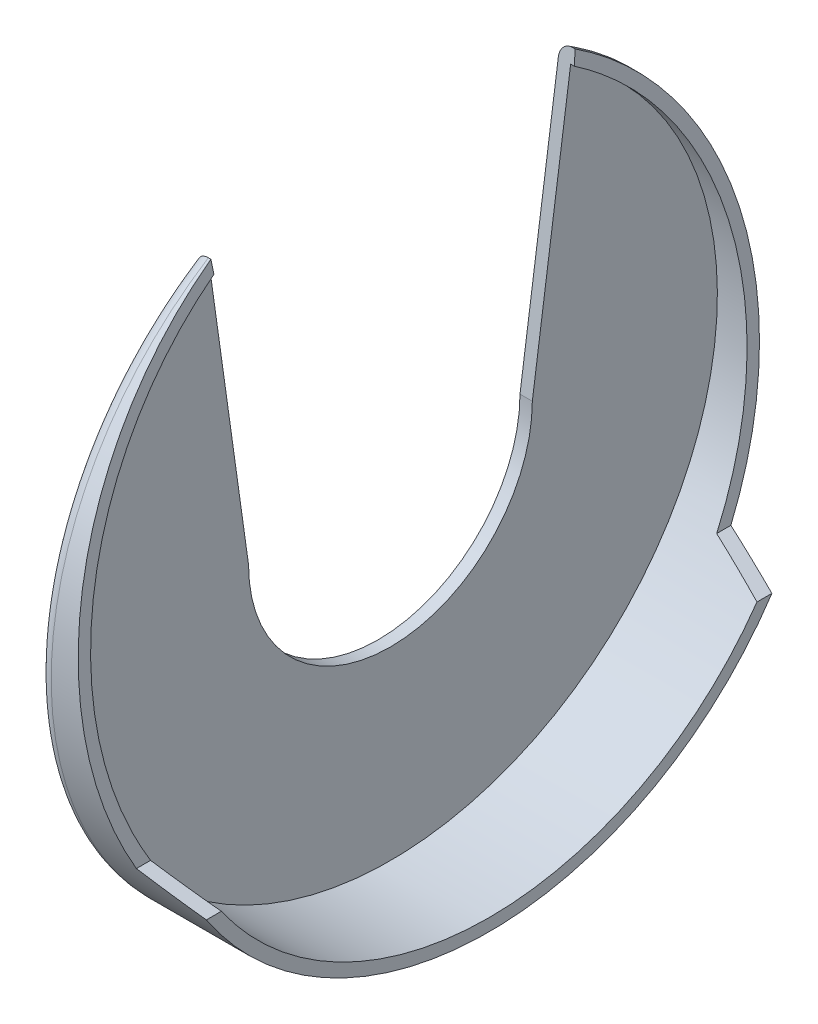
ISO-10303-21;
HEADER;
FILE_DESCRIPTION(('STEP AP214'),'2;1');
FILE_NAME('part.step','',(''),(''),'','','');
FILE_SCHEMA(('AUTOMOTIVE_DESIGN { 1 0 10303 214 1 1 1 1 }'));
ENDSEC;
DATA;
#1=APPLICATION_CONTEXT('core data for automotive mechanical design processes');
#2=APPLICATION_PROTOCOL_DEFINITION('international standard','automotive_design',2000,#1);
#3=PRODUCT_CONTEXT('',#1,'mechanical');
#4=PRODUCT('Part','Part','',(#3));
#5=PRODUCT_RELATED_PRODUCT_CATEGORY('part','',(#4));
#6=PRODUCT_DEFINITION_FORMATION('','',#4);
#7=PRODUCT_DEFINITION_CONTEXT('part definition',#1,'design');
#8=PRODUCT_DEFINITION('design','',#6,#7);
#9=PRODUCT_DEFINITION_SHAPE('','',#8);
#10=(LENGTH_UNIT() NAMED_UNIT(*) SI_UNIT(.MILLI.,.METRE.));
#11=(NAMED_UNIT(*) PLANE_ANGLE_UNIT() SI_UNIT($,.RADIAN.));
#12=(NAMED_UNIT(*) SI_UNIT($,.STERADIAN.) SOLID_ANGLE_UNIT());
#13=UNCERTAINTY_MEASURE_WITH_UNIT(LENGTH_MEASURE(1.E-05),#10,'distance_accuracy_value','');
#14=(GEOMETRIC_REPRESENTATION_CONTEXT(3) GLOBAL_UNCERTAINTY_ASSIGNED_CONTEXT((#13)) GLOBAL_UNIT_ASSIGNED_CONTEXT((#10,
#11,#12)) REPRESENTATION_CONTEXT('',''));
#15=CARTESIAN_POINT('',(0.,0.,0.));
#16=DIRECTION('',(0.,0.,1.));
#17=DIRECTION('',(1.,0.,0.));
#18=AXIS2_PLACEMENT_3D('',#15,#16,#17);
#19=CARTESIAN_POINT('',(9.,0.,0.));
#20=DIRECTION('',(-1.,0.,0.));
#21=DIRECTION('',(0.,0.,1.));
#22=AXIS2_PLACEMENT_3D('',#19,#20,#21);
#23=CYLINDRICAL_SURFACE('',#22,11.5);
#24=CARTESIAN_POINT('',(0.999999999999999,0.,0.));
#25=DIRECTION('',(1.,0.,0.));
#26=DIRECTION('',(0.,0.,-1.));
#27=AXIS2_PLACEMENT_3D('',#24,#25,#26);
#28=CIRCLE('',#27,11.5);
#29=CARTESIAN_POINT('',(0.999999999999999,0.,-11.5));
#30=VERTEX_POINT('',#29);
#31=CARTESIAN_POINT('',(0.999999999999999,0.,11.5));
#32=VERTEX_POINT('',#31);
#33=EDGE_CURVE('E137',#30,#32,#28,.F.);
#34=ORIENTED_EDGE('',*,*,#33,.F.);
#35=DIRECTION('',(-1.,0.,0.));
#36=VECTOR('',#35,1.);
#37=CARTESIAN_POINT('',(9.,0.,-11.5));
#38=LINE('',#37,#36);
#39=CARTESIAN_POINT('',(0.,0.,-11.5));
#40=VERTEX_POINT('',#39);
#41=EDGE_CURVE('E155',#30,#40,#38,.T.);
#42=ORIENTED_EDGE('',*,*,#41,.T.);
#43=CARTESIAN_POINT('',(0.,0.,0.));
#44=DIRECTION('',(-1.,0.,0.));
#45=DIRECTION('',(0.,0.,-1.));
#46=AXIS2_PLACEMENT_3D('',#43,#44,#45);
#47=CIRCLE('',#46,11.5);
#48=CARTESIAN_POINT('',(0.,0.,11.5));
#49=VERTEX_POINT('',#48);
#50=EDGE_CURVE('E147',#40,#49,#47,.T.);
#51=ORIENTED_EDGE('',*,*,#50,.T.);
#52=DIRECTION('',(-1.,0.,0.));
#53=VECTOR('',#52,1.);
#54=CARTESIAN_POINT('',(9.,0.,11.5));
#55=LINE('',#54,#53);
#56=EDGE_CURVE('E168',#32,#49,#55,.T.);
#57=ORIENTED_EDGE('',*,*,#56,.F.);
#58=EDGE_LOOP('',(#34,#42,#51,#57));
#59=FACE_BOUND('',#58,.T.);
#60=ADVANCED_FACE('F31',(#59),#23,.F.);
#61=CARTESIAN_POINT('',(9.,0.,11.5));
#62=DIRECTION('',(0.,-0.139173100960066,0.99026806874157));
#63=DIRECTION('',(0.,-0.99026806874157,-0.139173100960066));
#64=AXIS2_PLACEMENT_3D('',#61,#62,#63);
#65=PLANE('',#64);
#66=DIRECTION('',(0.,0.99026806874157,0.139173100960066));
#67=VECTOR('',#66,1.);
#68=CARTESIAN_POINT('',(0.999999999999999,0.,11.5));
#69=LINE('',#68,#67);
#70=CARTESIAN_POINT('',(1.,22.1104758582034,14.607424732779));
#71=VERTEX_POINT('',#70);
#72=EDGE_CURVE('E208',#32,#71,#69,.T.);
#73=ORIENTED_EDGE('',*,*,#72,.F.);
#74=ORIENTED_EDGE('',*,*,#56,.T.);
#75=DIRECTION('',(0.,0.99026806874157,0.139173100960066));
#76=VECTOR('',#75,1.);
#77=CARTESIAN_POINT('',(0.,0.,11.5));
#78=LINE('',#77,#76);
#79=CARTESIAN_POINT('',(0.,22.1104758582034,14.607424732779));
#80=VERTEX_POINT('',#79);
#81=EDGE_CURVE('E159',#49,#80,#78,.T.);
#82=ORIENTED_EDGE('',*,*,#81,.T.);
#83=CARTESIAN_POINT('',(0.,22.1104758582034,14.607424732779));
#84=CARTESIAN_POINT('',(-2.5102654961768E-05,22.176980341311,14.6167713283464));
#85=CARTESIAN_POINT('',(0.00551615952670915,22.2435188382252,14.6261227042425));
#86=CARTESIAN_POINT('',(0.0276561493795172,22.3749565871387,14.6445950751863));
#87=CARTESIAN_POINT('',(0.0442864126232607,22.4398506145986,14.6537153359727));
#88=CARTESIAN_POINT('',(0.0885669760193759,22.5660011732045,14.6714446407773));
#89=CARTESIAN_POINT('',(0.116236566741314,22.6272511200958,14.6800527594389));
#90=CARTESIAN_POINT('',(0.182183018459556,22.7438163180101,14.696434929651));
#91=CARTESIAN_POINT('',(0.22044651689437,22.799138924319,14.7042100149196));
#92=CARTESIAN_POINT('',(0.304232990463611,22.8985962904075,14.718187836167));
#93=CARTESIAN_POINT('',(0.349182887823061,22.9432030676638,14.724456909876));
#94=CARTESIAN_POINT('',(0.44674102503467,23.0233421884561,14.7357197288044));
#95=CARTESIAN_POINT('',(0.499347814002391,23.0588762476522,14.7407137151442));
#96=CARTESIAN_POINT('',(0.605167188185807,23.1161435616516,14.7487621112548));
#97=CARTESIAN_POINT('',(0.657827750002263,23.1388800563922,14.7519575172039));
#98=CARTESIAN_POINT('',(0.766420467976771,23.1743857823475,14.7569475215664));
#99=CARTESIAN_POINT('',(0.822345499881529,23.1871759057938,14.7587450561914));
#100=CARTESIAN_POINT('',(0.898984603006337,23.1973558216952,14.7601757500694));
#101=CARTESIAN_POINT('',(0.919150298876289,23.1993580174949,14.7604571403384));
#102=CARTESIAN_POINT('',(0.959540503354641,23.2020259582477,14.7608320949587));
#103=CARTESIAN_POINT('',(0.979764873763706,23.2026937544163,14.7609259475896));
#104=CARTESIAN_POINT('',(0.999999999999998,23.2026950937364,14.7609261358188));
#105=B_SPLINE_CURVE_WITH_KNOTS('',3,(#83,#84,#85,#86,#87,#88,#89,#90,#91,#92,#93,#94,#95,#96,
#97,#98,#99,#100,#101,#102,#103,#104),.UNSPECIFIED.,.F.,.F.,(4,2,2,2,2,2,2,2,2,2,4),(0.,
0.201303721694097,0.403182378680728,0.605415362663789,0.807394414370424,0.997258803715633,
1.1870872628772,1.35853251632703,1.52961667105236,1.59038289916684,1.65105564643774),.UNSPECIFIED.);
#106=CARTESIAN_POINT('',(0.999999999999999,23.2026950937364,14.7609261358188));
#107=VERTEX_POINT('',#106);
#108=EDGE_CURVE('E11',#80,#107,#105,.T.);
#109=ORIENTED_EDGE('',*,*,#108,.T.);
#110=DIRECTION('',(-1.,0.,0.));
#111=VECTOR('',#110,1.);
#112=CARTESIAN_POINT('',(9.,23.2026950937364,14.7609261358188));
#113=LINE('',#112,#111);
#114=CARTESIAN_POINT('',(1.2029376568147,23.2026950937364,14.7609261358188));
#115=VERTEX_POINT('',#114);
#116=EDGE_CURVE('E143',#115,#107,#113,.T.);
#117=ORIENTED_EDGE('',*,*,#116,.F.);
#118=DIRECTION('',(-0.0891855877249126,0.986321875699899,0.138618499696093));
#119=VECTOR('',#118,1.);
#120=CARTESIAN_POINT('',(3.34631134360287,-0.501318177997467,11.4295443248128));
#121=LINE('',#120,#119);
#122=CARTESIAN_POINT('',(1.30169873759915,22.1104758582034,14.607424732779));
#123=VERTEX_POINT('',#122);
#124=EDGE_CURVE('E133',#123,#115,#121,.T.);
#125=ORIENTED_EDGE('',*,*,#124,.F.);
#126=DIRECTION('',(-1.,0.,0.));
#127=VECTOR('',#126,1.);
#128=CARTESIAN_POINT('',(9.,22.1104758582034,14.607424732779));
#129=LINE('',#128,#127);
#130=EDGE_CURVE('E117',#123,#71,#129,.T.);
#131=ORIENTED_EDGE('',*,*,#130,.T.);
#132=EDGE_LOOP('',(#73,#74,#82,#109,#117,#125,#131));
#133=FACE_BOUND('',#132,.T.);
#134=ADVANCED_FACE('F141',(#133),#65,.F.);
#135=CARTESIAN_POINT('',(9.,0.,-11.5));
#136=DIRECTION('',(0.,-0.139173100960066,-0.99026806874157));
#137=DIRECTION('',(0.,0.99026806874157,-0.139173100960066));
#138=AXIS2_PLACEMENT_3D('',#135,#136,#137);
#139=PLANE('',#138);
#140=DIRECTION('',(-1.,0.,0.));
#141=VECTOR('',#140,1.);
#142=CARTESIAN_POINT('',(1.30169873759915,22.1104758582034,-14.607424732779));
#143=LINE('',#142,#141);
#144=CARTESIAN_POINT('',(1.30169873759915,22.1104758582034,-14.607424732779));
#145=VERTEX_POINT('',#144);
#146=CARTESIAN_POINT('',(1.,22.1104758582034,-14.607424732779));
#147=VERTEX_POINT('',#146);
#148=EDGE_CURVE('E128',#145,#147,#143,.T.);
#149=ORIENTED_EDGE('',*,*,#148,.F.);
#150=DIRECTION('',(0.0891855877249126,-0.986321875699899,0.138618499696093));
#151=VECTOR('',#150,1.);
#152=CARTESIAN_POINT('',(3.34631134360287,-0.501318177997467,-11.4295443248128));
#153=LINE('',#152,#151);
#154=CARTESIAN_POINT('',(1.2029376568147,23.2026950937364,-14.7609261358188));
#155=VERTEX_POINT('',#154);
#156=EDGE_CURVE('E174',#155,#145,#153,.T.);
#157=ORIENTED_EDGE('',*,*,#156,.F.);
#158=DIRECTION('',(-1.,0.,0.));
#159=VECTOR('',#158,1.);
#160=CARTESIAN_POINT('',(9.,23.2026950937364,-14.7609261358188));
#161=LINE('',#160,#159);
#162=CARTESIAN_POINT('',(0.999999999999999,23.2026950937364,-14.7609261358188));
#163=VERTEX_POINT('',#162);
#164=EDGE_CURVE('E164',#155,#163,#161,.T.);
#165=ORIENTED_EDGE('',*,*,#164,.T.);
#166=CARTESIAN_POINT('',(0.999999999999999,23.2026950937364,-14.7609261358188));
#167=CARTESIAN_POINT('',(0.973701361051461,23.2026961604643,-14.7609262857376));
#168=CARTESIAN_POINT('',(0.947416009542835,23.2015656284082,-14.7607673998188));
#169=CARTESIAN_POINT('',(0.895047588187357,23.1970639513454,-14.7601347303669));
#170=CARTESIAN_POINT('',(0.868964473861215,23.1936933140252,-14.7596610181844));
#171=CARTESIAN_POINT('',(0.791470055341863,23.1802899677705,-14.757777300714));
#172=CARTESIAN_POINT('',(0.740601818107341,23.166965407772,-14.7559046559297));
#173=CARTESIAN_POINT('',(0.641890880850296,23.1320964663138,-14.751004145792));
#174=CARTESIAN_POINT('',(0.594047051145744,23.1105551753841,-14.7479767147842));
#175=CARTESIAN_POINT('',(0.502496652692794,23.0600836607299,-14.740883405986));
#176=CARTESIAN_POINT('',(0.458792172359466,23.0311497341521,-14.7368170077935));
#177=CARTESIAN_POINT('',(0.375018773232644,22.9657665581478,-14.7276280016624));
#178=CARTESIAN_POINT('',(0.335133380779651,22.9290874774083,-14.7224730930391));
#179=CARTESIAN_POINT('',(0.2615558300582,22.8500895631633,-14.7113706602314));
#180=CARTESIAN_POINT('',(0.227865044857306,22.8077694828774,-14.7054229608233));
#181=CARTESIAN_POINT('',(0.164580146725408,22.714880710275,-14.6923682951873));
#182=CARTESIAN_POINT('',(0.135578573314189,22.6639165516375,-14.6852057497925));
#183=CARTESIAN_POINT('',(0.0858017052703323,22.5581677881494,-14.6703437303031));
#184=CARTESIAN_POINT('',(0.0650323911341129,22.5033804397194,-14.6626438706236));
#185=CARTESIAN_POINT('',(0.032327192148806,22.3927096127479,-14.6470901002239));
#186=CARTESIAN_POINT('',(0.0201931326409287,22.3368831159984,-14.6392441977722));
#187=CARTESIAN_POINT('',(0.00403072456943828,22.2241901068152,-14.6234062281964));
#188=CARTESIAN_POINT('',(-1.20457555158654E-05,22.167325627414,-14.6154144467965));
#189=CARTESIAN_POINT('',(0.,22.1104758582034,-14.607424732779));
#190=B_SPLINE_CURVE_WITH_KNOTS('',3,(#166,#167,#168,#169,#170,#171,#172,#173,#174,#175,#176,
#177,#178,#179,#180,#181,#182,#183,#184,#185,#186,#187,#188,#189),.UNSPECIFIED.,.F.,.F.,(4,2,2,
2,2,2,2,2,2,2,2,4),(0.,0.0788451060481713,0.157672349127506,0.314699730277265,0.471668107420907,
0.628715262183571,0.791323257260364,0.953967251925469,1.13045098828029,1.3070627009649,
1.47947772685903,1.6515851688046),.UNSPECIFIED.);
#191=CARTESIAN_POINT('',(0.,22.1104758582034,-14.607424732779));
#192=VERTEX_POINT('',#191);
#193=EDGE_CURVE('E180',#163,#192,#190,.T.);
#194=ORIENTED_EDGE('',*,*,#193,.T.);
#195=DIRECTION('',(0.,-0.99026806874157,0.139173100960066));
#196=VECTOR('',#195,1.);
#197=CARTESIAN_POINT('',(0.,0.,-11.5));
#198=LINE('',#197,#196);
#199=EDGE_CURVE('E156',#192,#40,#198,.T.);
#200=ORIENTED_EDGE('',*,*,#199,.T.);
#201=ORIENTED_EDGE('',*,*,#41,.F.);
#202=DIRECTION('',(0.,-0.99026806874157,0.139173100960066));
#203=VECTOR('',#202,1.);
#204=CARTESIAN_POINT('',(0.999999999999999,0.,-11.5));
#205=LINE('',#204,#203);
#206=EDGE_CURVE('E212',#147,#30,#205,.T.);
#207=ORIENTED_EDGE('',*,*,#206,.F.);
#208=EDGE_LOOP('',(#149,#157,#165,#194,#200,#201,#207));
#209=FACE_BOUND('',#208,.T.);
#210=ADVANCED_FACE('F185',(#209),#139,.F.);
#211=CARTESIAN_POINT('',(1.2029376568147,23.2026950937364,108.555372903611));
#212=DIRECTION('',(0.995936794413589,0.0900549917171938,0.));
#213=DIRECTION('',(-0.0900549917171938,0.99593679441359,0.));
#214=AXIS2_PLACEMENT_3D('',#211,#212,#213);
#215=PLANE('',#214);
#216=CARTESIAN_POINT('',(3.30098095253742,0.,0.));
#217=DIRECTION('',(0.995936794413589,0.0900549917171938,0.));
#218=DIRECTION('',(-0.0900549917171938,0.995936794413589,0.));
#219=AXIS2_PLACEMENT_3D('',#216,#217,#218);
#220=ELLIPSE('',#219,26.6081142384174,26.5);
#221=CARTESIAN_POINT('',(4.5,-13.2601998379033,22.9437812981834));
#222=VERTEX_POINT('',#221);
#223=EDGE_CURVE('E120',#123,#222,#220,.T.);
#224=ORIENTED_EDGE('',*,*,#223,.F.);
#225=ORIENTED_EDGE('',*,*,#124,.T.);
#226=CARTESIAN_POINT('',(3.30098095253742,0.,0.));
#227=DIRECTION('',(0.995936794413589,0.0900549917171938,0.));
#228=DIRECTION('',(-0.0900549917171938,0.995936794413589,0.));
#229=AXIS2_PLACEMENT_3D('',#226,#227,#228);
#230=ELLIPSE('',#229,27.6121940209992,27.5);
#231=CARTESIAN_POINT('',(4.5,-13.2601998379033,24.0918471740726));
#232=VERTEX_POINT('',#231);
#233=EDGE_CURVE('E144',#115,#232,#230,.T.);
#234=ORIENTED_EDGE('',*,*,#233,.T.);
#235=DIRECTION('',(0.,0.,-1.));
#236=VECTOR('',#235,1.);
#237=CARTESIAN_POINT('',(4.5,-13.2601998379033,108.555372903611));
#238=LINE('',#237,#236);
#239=EDGE_CURVE('E136',#232,#222,#238,.T.);
#240=ORIENTED_EDGE('',*,*,#239,.T.);
#241=EDGE_LOOP('',(#224,#225,#234,#240));
#242=FACE_BOUND('',#241,.T.);
#243=ADVANCED_FACE('F132',(#242),#215,.T.);
#244=CARTESIAN_POINT('',(4.5,-13.2601998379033,108.555372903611));
#245=DIRECTION('',(0.39558185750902,0.91843072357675,0.));
#246=DIRECTION('',(-0.91843072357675,0.395581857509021,0.));
#247=AXIS2_PLACEMENT_3D('',#244,#245,#246);
#248=PLANE('',#247);
#249=CARTESIAN_POINT('',(-26.2864850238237,0.,0.));
#250=DIRECTION('',(0.39558185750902,0.91843072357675,0.));
#251=DIRECTION('',(-0.91843072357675,0.395581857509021,0.));
#252=AXIS2_PLACEMENT_3D('',#249,#250,#251);
#253=ELLIPSE('',#252,66.9899276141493,26.5);
#254=CARTESIAN_POINT('',(9.,-15.1984171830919,21.7084802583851));
#255=VERTEX_POINT('',#254);
#256=EDGE_CURVE('E241',#222,#255,#253,.T.);
#257=ORIENTED_EDGE('',*,*,#256,.F.);
#258=ORIENTED_EDGE('',*,*,#239,.F.);
#259=CARTESIAN_POINT('',(-26.2864850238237,0.,0.));
#260=DIRECTION('',(0.39558185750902,0.91843072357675,0.));
#261=DIRECTION('',(-0.91843072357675,0.395581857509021,0.));
#262=AXIS2_PLACEMENT_3D('',#259,#260,#261);
#263=ELLIPSE('',#262,69.5178494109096,27.5);
#264=CARTESIAN_POINT('',(9.,-15.1984171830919,22.9185103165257));
#265=VERTEX_POINT('',#264);
#266=EDGE_CURVE('E149',#232,#265,#263,.T.);
#267=ORIENTED_EDGE('',*,*,#266,.T.);
#268=DIRECTION('',(0.,0.,1.));
#269=VECTOR('',#268,1.);
#270=CARTESIAN_POINT('',(9.,-15.1984171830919,0.));
#271=LINE('',#270,#269);
#272=EDGE_CURVE('E170',#255,#265,#271,.T.);
#273=ORIENTED_EDGE('',*,*,#272,.F.);
#274=EDGE_LOOP('',(#257,#258,#267,#273));
#275=FACE_BOUND('',#274,.T.);
#276=ADVANCED_FACE('F196',(#275),#248,.T.);
#277=CARTESIAN_POINT('',(9.,0.,0.));
#278=DIRECTION('',(-1.,0.,0.));
#279=DIRECTION('',(0.,0.,1.));
#280=AXIS2_PLACEMENT_3D('',#277,#278,#279);
#281=CYLINDRICAL_SURFACE('',#280,27.5);
#282=ORIENTED_EDGE('',*,*,#116,.T.);
#283=CARTESIAN_POINT('',(0.999999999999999,0.,0.));
#284=DIRECTION('',(1.,0.,0.));
#285=DIRECTION('',(0.,0.,-1.));
#286=AXIS2_PLACEMENT_3D('',#283,#284,#285);
#287=CIRCLE('',#286,27.5);
#288=EDGE_CURVE('E177',#107,#163,#287,.T.);
#289=ORIENTED_EDGE('',*,*,#288,.T.);
#290=ORIENTED_EDGE('',*,*,#164,.F.);
#291=CARTESIAN_POINT('',(4.5,-13.2601998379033,-24.0918471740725));
#292=VERTEX_POINT('',#291);
#293=EDGE_CURVE('E145',#292,#155,#230,.T.);
#294=ORIENTED_EDGE('',*,*,#293,.F.);
#295=CARTESIAN_POINT('',(9.,-15.1984171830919,-22.9185103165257));
#296=VERTEX_POINT('',#295);
#297=EDGE_CURVE('E228',#296,#292,#263,.T.);
#298=ORIENTED_EDGE('',*,*,#297,.F.);
#299=CARTESIAN_POINT('',(9.,0.,0.));
#300=DIRECTION('',(1.,0.,0.));
#301=DIRECTION('',(0.,0.,-1.));
#302=AXIS2_PLACEMENT_3D('',#299,#300,#301);
#303=CIRCLE('',#302,27.5);
#304=EDGE_CURVE('E152',#265,#296,#303,.T.);
#305=ORIENTED_EDGE('',*,*,#304,.F.);
#306=ORIENTED_EDGE('',*,*,#266,.F.);
#307=ORIENTED_EDGE('',*,*,#233,.F.);
#308=EDGE_LOOP('',(#282,#289,#290,#294,#298,#305,#306,#307));
#309=FACE_BOUND('',#308,.T.);
#310=ADVANCED_FACE('F193',(#309),#281,.T.);
#311=CARTESIAN_POINT('',(9.,0.,0.));
#312=DIRECTION('',(1.,0.,0.));
#313=DIRECTION('',(0.,0.,-1.));
#314=AXIS2_PLACEMENT_3D('',#311,#312,#313);
#315=PLANE('',#314);
#316=CARTESIAN_POINT('',(9.,0.,0.));
#317=DIRECTION('',(1.,0.,0.));
#318=DIRECTION('',(0.,0.,-1.));
#319=AXIS2_PLACEMENT_3D('',#316,#317,#318);
#320=CIRCLE('',#319,26.5);
#321=CARTESIAN_POINT('',(9.,-15.1984171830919,-21.7084802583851));
#322=VERTEX_POINT('',#321);
#323=EDGE_CURVE('E51',#255,#322,#320,.T.);
#324=ORIENTED_EDGE('',*,*,#323,.F.);
#325=ORIENTED_EDGE('',*,*,#272,.T.);
#326=ORIENTED_EDGE('',*,*,#304,.T.);
#327=EDGE_CURVE('E171',#296,#322,#271,.T.);
#328=ORIENTED_EDGE('',*,*,#327,.T.);
#329=EDGE_LOOP('',(#324,#325,#326,#328));
#330=FACE_BOUND('',#329,.T.);
#331=ADVANCED_FACE('F195',(#330),#315,.T.);
#332=CARTESIAN_POINT('',(0.,0.,0.));
#333=DIRECTION('',(1.,0.,0.));
#334=DIRECTION('',(0.,0.,-1.));
#335=AXIS2_PLACEMENT_3D('',#332,#333,#334);
#336=PLANE('',#335);
#337=ORIENTED_EDGE('',*,*,#199,.F.);
#338=CARTESIAN_POINT('',(0.,0.,0.));
#339=DIRECTION('',(1.,0.,0.));
#340=DIRECTION('',(0.,0.,-1.));
#341=AXIS2_PLACEMENT_3D('',#338,#339,#340);
#342=CIRCLE('',#341,26.5);
#343=EDGE_CURVE('E44',#192,#80,#342,.F.);
#344=ORIENTED_EDGE('',*,*,#343,.T.);
#345=ORIENTED_EDGE('',*,*,#81,.F.);
#346=ORIENTED_EDGE('',*,*,#50,.F.);
#347=EDGE_LOOP('',(#337,#344,#345,#346));
#348=FACE_BOUND('',#347,.T.);
#349=ADVANCED_FACE('F191',(#348),#336,.F.);
#350=CARTESIAN_POINT('',(3.30098095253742,0.,0.));
#351=DIRECTION('',(0.995936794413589,0.0900549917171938,0.));
#352=DIRECTION('',(-0.0900549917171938,0.995936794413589,0.));
#353=AXIS2_PLACEMENT_3D('',#350,#351,#352);
#354=ELLIPSE('',#353,26.6081142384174,26.5);
#355=CARTESIAN_POINT('',(4.5,-13.2601998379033,-22.9437812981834));
#356=VERTEX_POINT('',#355);
#357=EDGE_CURVE('E138',#356,#145,#354,.T.);
#358=ORIENTED_EDGE('',*,*,#357,.F.);
#359=EDGE_CURVE('E224',#356,#292,#238,.T.);
#360=ORIENTED_EDGE('',*,*,#359,.T.);
#361=ORIENTED_EDGE('',*,*,#293,.T.);
#362=ORIENTED_EDGE('',*,*,#156,.T.);
#363=EDGE_LOOP('',(#358,#360,#361,#362));
#364=FACE_BOUND('',#363,.T.);
#365=ADVANCED_FACE('F222',(#364),#215,.T.);
#366=CARTESIAN_POINT('',(-26.2864850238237,0.,0.));
#367=DIRECTION('',(0.39558185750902,0.91843072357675,0.));
#368=DIRECTION('',(-0.91843072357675,0.395581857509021,0.));
#369=AXIS2_PLACEMENT_3D('',#366,#367,#368);
#370=ELLIPSE('',#369,66.9899276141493,26.5);
#371=EDGE_CURVE('E242',#322,#356,#370,.T.);
#372=ORIENTED_EDGE('',*,*,#371,.F.);
#373=ORIENTED_EDGE('',*,*,#327,.F.);
#374=ORIENTED_EDGE('',*,*,#297,.T.);
#375=ORIENTED_EDGE('',*,*,#359,.F.);
#376=EDGE_LOOP('',(#372,#373,#374,#375));
#377=FACE_BOUND('',#376,.T.);
#378=ADVANCED_FACE('F246',(#377),#248,.T.);
#379=CARTESIAN_POINT('',(0.999999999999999,0.,0.));
#380=DIRECTION('',(1.,0.,0.));
#381=DIRECTION('',(0.,0.,-1.));
#382=AXIS2_PLACEMENT_3D('',#379,#380,#381);
#383=TOROIDAL_SURFACE('',#382,26.5,1.);
#384=ORIENTED_EDGE('',*,*,#108,.F.);
#385=ORIENTED_EDGE('',*,*,#343,.F.);
#386=ORIENTED_EDGE('',*,*,#193,.F.);
#387=ORIENTED_EDGE('',*,*,#288,.F.);
#388=EDGE_LOOP('',(#384,#385,#386,#387));
#389=FACE_BOUND('',#388,.T.);
#390=ADVANCED_FACE('F33',(#389),#383,.T.);
#391=CARTESIAN_POINT('',(9.,0.,0.));
#392=DIRECTION('',(-1.,0.,0.));
#393=DIRECTION('',(0.,0.,1.));
#394=AXIS2_PLACEMENT_3D('',#391,#392,#393);
#395=CYLINDRICAL_SURFACE('',#394,26.5);
#396=ORIENTED_EDGE('',*,*,#130,.F.);
#397=ORIENTED_EDGE('',*,*,#223,.T.);
#398=ORIENTED_EDGE('',*,*,#256,.T.);
#399=ORIENTED_EDGE('',*,*,#323,.T.);
#400=ORIENTED_EDGE('',*,*,#371,.T.);
#401=ORIENTED_EDGE('',*,*,#357,.T.);
#402=ORIENTED_EDGE('',*,*,#148,.T.);
#403=CARTESIAN_POINT('',(0.999999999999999,0.,0.));
#404=DIRECTION('',(1.,0.,0.));
#405=DIRECTION('',(0.,0.,-1.));
#406=AXIS2_PLACEMENT_3D('',#403,#404,#405);
#407=CIRCLE('',#406,26.5);
#408=EDGE_CURVE('E123',#147,#71,#407,.F.);
#409=ORIENTED_EDGE('',*,*,#408,.T.);
#410=EDGE_LOOP('',(#396,#397,#398,#399,#400,#401,#402,#409));
#411=FACE_BOUND('',#410,.T.);
#412=ADVANCED_FACE('F119',(#411),#395,.F.);
#413=CARTESIAN_POINT('',(1.,0.,0.));
#414=DIRECTION('',(1.,0.,0.));
#415=DIRECTION('',(0.,0.,-1.));
#416=AXIS2_PLACEMENT_3D('',#413,#414,#415);
#417=PLANE('',#416);
#418=ORIENTED_EDGE('',*,*,#206,.T.);
#419=ORIENTED_EDGE('',*,*,#33,.T.);
#420=ORIENTED_EDGE('',*,*,#72,.T.);
#421=ORIENTED_EDGE('',*,*,#408,.F.);
#422=EDGE_LOOP('',(#418,#419,#420,#421));
#423=FACE_BOUND('',#422,.T.);
#424=ADVANCED_FACE('F290',(#423),#417,.T.);
#425=CLOSED_SHELL('',(#60,#134,#210,#243,#276,#310,#331,#349,#365,#378,#390,#412,#424));
#426=MANIFOLD_SOLID_BREP('B2',#425);
#427=ADVANCED_BREP_SHAPE_REPRESENTATION('',(#18,#426),#14);
#428=SHAPE_DEFINITION_REPRESENTATION(#9,#427);
ENDSEC;
END-ISO-10303-21;
